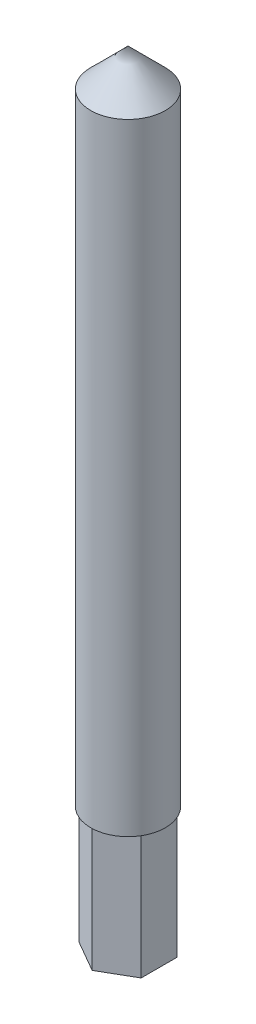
ISO-10303-21;
HEADER;
FILE_DESCRIPTION(('STEP AP214'),'2;1');
FILE_NAME('part.step','',(''),(''),'','','');
FILE_SCHEMA(('AUTOMOTIVE_DESIGN { 1 0 10303 214 1 1 1 1 }'));
ENDSEC;
DATA;
#1=APPLICATION_CONTEXT('core data for automotive mechanical design processes');
#2=APPLICATION_PROTOCOL_DEFINITION('international standard','automotive_design',2000,#1);
#3=PRODUCT_CONTEXT('',#1,'mechanical');
#4=PRODUCT('Part','Part','',(#3));
#5=PRODUCT_RELATED_PRODUCT_CATEGORY('part','',(#4));
#6=PRODUCT_DEFINITION_FORMATION('','',#4);
#7=PRODUCT_DEFINITION_CONTEXT('part definition',#1,'design');
#8=PRODUCT_DEFINITION('design','',#6,#7);
#9=PRODUCT_DEFINITION_SHAPE('','',#8);
#10=(LENGTH_UNIT() NAMED_UNIT(*) SI_UNIT(.MILLI.,.METRE.));
#11=(NAMED_UNIT(*) PLANE_ANGLE_UNIT() SI_UNIT($,.RADIAN.));
#12=(NAMED_UNIT(*) SI_UNIT($,.STERADIAN.) SOLID_ANGLE_UNIT());
#13=UNCERTAINTY_MEASURE_WITH_UNIT(LENGTH_MEASURE(1.E-05),#10,'distance_accuracy_value','');
#14=(GEOMETRIC_REPRESENTATION_CONTEXT(3) GLOBAL_UNCERTAINTY_ASSIGNED_CONTEXT((#13)) GLOBAL_UNIT_ASSIGNED_CONTEXT((#10,
#11,#12)) REPRESENTATION_CONTEXT('',''));
#15=CARTESIAN_POINT('',(0.,0.,0.));
#16=DIRECTION('',(0.,0.,1.));
#17=DIRECTION('',(1.,0.,0.));
#18=AXIS2_PLACEMENT_3D('',#15,#16,#17);
#19=CARTESIAN_POINT('',(0.,120.,0.));
#20=DIRECTION('',(0.,-1.,0.));
#21=DIRECTION('',(0.,0.,-1.));
#22=AXIS2_PLACEMENT_3D('',#19,#20,#21);
#23=CYLINDRICAL_SURFACE('',#22,6.);
#24=CARTESIAN_POINT('',(0.,120.,0.));
#25=DIRECTION('',(0.,1.,0.));
#26=DIRECTION('',(0.,0.,1.));
#27=AXIS2_PLACEMENT_3D('',#24,#25,#26);
#28=CIRCLE('',#27,6.);
#29=CARTESIAN_POINT('',(0.,120.,6.));
#30=VERTEX_POINT('',#29);
#31=EDGE_CURVE('E11',#30,#30,#28,.T.);
#32=ORIENTED_EDGE('',*,*,#31,.F.);
#33=EDGE_LOOP('',(#32));
#34=FACE_BOUND('',#33,.T.);
#35=CARTESIAN_POINT('',(0.,20.,0.));
#36=DIRECTION('',(0.,-1.,0.));
#37=DIRECTION('',(0.,0.,-1.));
#38=AXIS2_PLACEMENT_3D('',#35,#36,#37);
#39=CIRCLE('',#38,6.);
#40=CARTESIAN_POINT('',(0.,20.,-6.));
#41=VERTEX_POINT('',#40);
#42=EDGE_CURVE('E45',#41,#41,#39,.T.);
#43=ORIENTED_EDGE('',*,*,#42,.F.);
#44=EDGE_LOOP('',(#43));
#45=FACE_BOUND('',#44,.T.);
#46=ADVANCED_FACE('F38',(#34,#45),#23,.T.);
#47=CARTESIAN_POINT('',(0.,20.,0.));
#48=DIRECTION('',(0.,-1.,0.));
#49=DIRECTION('',(0.,0.,-1.));
#50=AXIS2_PLACEMENT_3D('',#47,#48,#49);
#51=PLANE('',#50);
#52=DIRECTION('',(-0.866025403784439,0.,-0.5));
#53=VECTOR('',#52,1.);
#54=CARTESIAN_POINT('',(-5.,20.,2.88675134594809));
#55=LINE('',#54,#53);
#56=CARTESIAN_POINT('',(0.,20.,5.77350269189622));
#57=VERTEX_POINT('',#56);
#58=CARTESIAN_POINT('',(-5.,20.,2.88675134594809));
#59=VERTEX_POINT('',#58);
#60=EDGE_CURVE('E113',#57,#59,#55,.T.);
#61=ORIENTED_EDGE('',*,*,#60,.F.);
#62=DIRECTION('',(-0.866025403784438,0.,0.5));
#63=VECTOR('',#62,1.);
#64=CARTESIAN_POINT('',(0.,20.,5.77350269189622));
#65=LINE('',#64,#63);
#66=CARTESIAN_POINT('',(5.00000000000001,20.,2.88675134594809));
#67=VERTEX_POINT('',#66);
#68=EDGE_CURVE('E122',#67,#57,#65,.T.);
#69=ORIENTED_EDGE('',*,*,#68,.F.);
#70=DIRECTION('',(0.,0.,1.));
#71=VECTOR('',#70,1.);
#72=CARTESIAN_POINT('',(5.00000000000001,20.,2.88675134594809));
#73=LINE('',#72,#71);
#74=CARTESIAN_POINT('',(5.00000000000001,20.,-2.88675134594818));
#75=VERTEX_POINT('',#74);
#76=EDGE_CURVE('E125',#75,#67,#73,.T.);
#77=ORIENTED_EDGE('',*,*,#76,.F.);
#78=DIRECTION('',(0.866025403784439,0.,0.5));
#79=VECTOR('',#78,1.);
#80=CARTESIAN_POINT('',(5.00000000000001,20.,-2.88675134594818));
#81=LINE('',#80,#79);
#82=CARTESIAN_POINT('',(0.,20.,-5.77350269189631));
#83=VERTEX_POINT('',#82);
#84=EDGE_CURVE('E60',#83,#75,#81,.T.);
#85=ORIENTED_EDGE('',*,*,#84,.F.);
#86=DIRECTION('',(0.866025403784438,0.,-0.500000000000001));
#87=VECTOR('',#86,1.);
#88=CARTESIAN_POINT('',(0.,20.,-5.77350269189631));
#89=LINE('',#88,#87);
#90=CARTESIAN_POINT('',(-5.00000000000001,20.,-2.88675134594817));
#91=VERTEX_POINT('',#90);
#92=EDGE_CURVE('E129',#91,#83,#89,.T.);
#93=ORIENTED_EDGE('',*,*,#92,.F.);
#94=DIRECTION('',(0.,0.,-1.));
#95=VECTOR('',#94,1.);
#96=CARTESIAN_POINT('',(-5.00000000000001,20.,-2.88675134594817));
#97=LINE('',#96,#95);
#98=EDGE_CURVE('E132',#59,#91,#97,.T.);
#99=ORIENTED_EDGE('',*,*,#98,.F.);
#100=EDGE_LOOP('',(#61,#69,#77,#85,#93,#99));
#101=FACE_BOUND('',#100,.T.);
#102=ORIENTED_EDGE('',*,*,#42,.T.);
#103=EDGE_LOOP('',(#102));
#104=FACE_BOUND('',#103,.T.);
#105=ADVANCED_FACE('F102',(#101,#104),#51,.T.);
#106=CARTESIAN_POINT('',(-5.00000000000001,20.,-2.88675134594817));
#107=DIRECTION('',(-1.,0.,0.));
#108=DIRECTION('',(0.,0.,1.));
#109=AXIS2_PLACEMENT_3D('',#106,#107,#108);
#110=PLANE('',#109);
#111=DIRECTION('',(0.,0.,-1.));
#112=VECTOR('',#111,1.);
#113=CARTESIAN_POINT('',(-5.00000000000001,0.,-2.88675134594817));
#114=LINE('',#113,#112);
#115=CARTESIAN_POINT('',(-5.,0.,2.88675134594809));
#116=VERTEX_POINT('',#115);
#117=CARTESIAN_POINT('',(-5.00000000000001,0.,-2.88675134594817));
#118=VERTEX_POINT('',#117);
#119=EDGE_CURVE('E148',#116,#118,#114,.T.);
#120=ORIENTED_EDGE('',*,*,#119,.F.);
#121=DIRECTION('',(0.,-1.,0.));
#122=VECTOR('',#121,1.);
#123=CARTESIAN_POINT('',(-5.,20.,2.88675134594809));
#124=LINE('',#123,#122);
#125=EDGE_CURVE('E106',#59,#116,#124,.T.);
#126=ORIENTED_EDGE('',*,*,#125,.F.);
#127=ORIENTED_EDGE('',*,*,#98,.T.);
#128=DIRECTION('',(0.,-1.,0.));
#129=VECTOR('',#128,1.);
#130=CARTESIAN_POINT('',(-5.00000000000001,20.,-2.88675134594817));
#131=LINE('',#130,#129);
#132=EDGE_CURVE('E110',#91,#118,#131,.T.);
#133=ORIENTED_EDGE('',*,*,#132,.T.);
#134=EDGE_LOOP('',(#120,#126,#127,#133));
#135=FACE_BOUND('',#134,.T.);
#136=ADVANCED_FACE('F155',(#135),#110,.T.);
#137=CARTESIAN_POINT('',(-5.,20.,2.88675134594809));
#138=DIRECTION('',(-0.5,0.,0.866025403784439));
#139=DIRECTION('',(0.866025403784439,0.,0.5));
#140=AXIS2_PLACEMENT_3D('',#137,#138,#139);
#141=PLANE('',#140);
#142=DIRECTION('',(-0.866025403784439,0.,-0.5));
#143=VECTOR('',#142,1.);
#144=CARTESIAN_POINT('',(-5.,0.,2.88675134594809));
#145=LINE('',#144,#143);
#146=CARTESIAN_POINT('',(0.,0.,5.77350269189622));
#147=VERTEX_POINT('',#146);
#148=EDGE_CURVE('E135',#147,#116,#145,.T.);
#149=ORIENTED_EDGE('',*,*,#148,.F.);
#150=DIRECTION('',(0.,-1.,0.));
#151=VECTOR('',#150,1.);
#152=CARTESIAN_POINT('',(0.,20.,5.77350269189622));
#153=LINE('',#152,#151);
#154=EDGE_CURVE('E107',#57,#147,#153,.T.);
#155=ORIENTED_EDGE('',*,*,#154,.F.);
#156=ORIENTED_EDGE('',*,*,#60,.T.);
#157=ORIENTED_EDGE('',*,*,#125,.T.);
#158=EDGE_LOOP('',(#149,#155,#156,#157));
#159=FACE_BOUND('',#158,.T.);
#160=ADVANCED_FACE('F169',(#159),#141,.T.);
#161=CARTESIAN_POINT('',(0.,20.,5.77350269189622));
#162=DIRECTION('',(0.5,0.,0.866025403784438));
#163=DIRECTION('',(0.866025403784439,0.,-0.5));
#164=AXIS2_PLACEMENT_3D('',#161,#162,#163);
#165=PLANE('',#164);
#166=DIRECTION('',(-0.866025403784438,0.,0.5));
#167=VECTOR('',#166,1.);
#168=CARTESIAN_POINT('',(0.,0.,5.77350269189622));
#169=LINE('',#168,#167);
#170=CARTESIAN_POINT('',(5.00000000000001,0.,2.88675134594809));
#171=VERTEX_POINT('',#170);
#172=EDGE_CURVE('E138',#171,#147,#169,.T.);
#173=ORIENTED_EDGE('',*,*,#172,.F.);
#174=DIRECTION('',(0.,-1.,0.));
#175=VECTOR('',#174,1.);
#176=CARTESIAN_POINT('',(5.00000000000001,20.,2.88675134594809));
#177=LINE('',#176,#175);
#178=EDGE_CURVE('E117',#67,#171,#177,.T.);
#179=ORIENTED_EDGE('',*,*,#178,.F.);
#180=ORIENTED_EDGE('',*,*,#68,.T.);
#181=ORIENTED_EDGE('',*,*,#154,.T.);
#182=EDGE_LOOP('',(#173,#179,#180,#181));
#183=FACE_BOUND('',#182,.T.);
#184=ADVANCED_FACE('F165',(#183),#165,.T.);
#185=CARTESIAN_POINT('',(5.00000000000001,20.,2.88675134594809));
#186=DIRECTION('',(1.,0.,0.));
#187=DIRECTION('',(0.,0.,-1.));
#188=AXIS2_PLACEMENT_3D('',#185,#186,#187);
#189=PLANE('',#188);
#190=DIRECTION('',(0.,0.,1.));
#191=VECTOR('',#190,1.);
#192=CARTESIAN_POINT('',(5.00000000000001,0.,2.88675134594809));
#193=LINE('',#192,#191);
#194=CARTESIAN_POINT('',(5.00000000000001,0.,-2.88675134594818));
#195=VERTEX_POINT('',#194);
#196=EDGE_CURVE('E141',#195,#171,#193,.T.);
#197=ORIENTED_EDGE('',*,*,#196,.F.);
#198=DIRECTION('',(0.,-1.,0.));
#199=VECTOR('',#198,1.);
#200=CARTESIAN_POINT('',(5.00000000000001,20.,-2.88675134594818));
#201=LINE('',#200,#199);
#202=EDGE_CURVE('E115',#75,#195,#201,.T.);
#203=ORIENTED_EDGE('',*,*,#202,.F.);
#204=ORIENTED_EDGE('',*,*,#76,.T.);
#205=ORIENTED_EDGE('',*,*,#178,.T.);
#206=EDGE_LOOP('',(#197,#203,#204,#205));
#207=FACE_BOUND('',#206,.T.);
#208=ADVANCED_FACE('F162',(#207),#189,.T.);
#209=CARTESIAN_POINT('',(5.00000000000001,20.,-2.88675134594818));
#210=DIRECTION('',(0.5,0.,-0.866025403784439));
#211=DIRECTION('',(-0.866025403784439,0.,-0.5));
#212=AXIS2_PLACEMENT_3D('',#209,#210,#211);
#213=PLANE('',#212);
#214=DIRECTION('',(0.866025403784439,0.,0.5));
#215=VECTOR('',#214,1.);
#216=CARTESIAN_POINT('',(5.00000000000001,0.,-2.88675134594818));
#217=LINE('',#216,#215);
#218=CARTESIAN_POINT('',(0.,0.,-5.77350269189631));
#219=VERTEX_POINT('',#218);
#220=EDGE_CURVE('E52',#219,#195,#217,.T.);
#221=ORIENTED_EDGE('',*,*,#220,.F.);
#222=DIRECTION('',(0.,-1.,0.));
#223=VECTOR('',#222,1.);
#224=CARTESIAN_POINT('',(0.,20.,-5.77350269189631));
#225=LINE('',#224,#223);
#226=EDGE_CURVE('E112',#83,#219,#225,.T.);
#227=ORIENTED_EDGE('',*,*,#226,.F.);
#228=ORIENTED_EDGE('',*,*,#84,.T.);
#229=ORIENTED_EDGE('',*,*,#202,.T.);
#230=EDGE_LOOP('',(#221,#227,#228,#229));
#231=FACE_BOUND('',#230,.T.);
#232=ADVANCED_FACE('F159',(#231),#213,.T.);
#233=CARTESIAN_POINT('',(0.,20.,-5.77350269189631));
#234=DIRECTION('',(-0.500000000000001,0.,-0.866025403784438));
#235=DIRECTION('',(-0.866025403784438,0.,0.500000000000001));
#236=AXIS2_PLACEMENT_3D('',#233,#234,#235);
#237=PLANE('',#236);
#238=DIRECTION('',(0.866025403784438,0.,-0.500000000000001));
#239=VECTOR('',#238,1.);
#240=CARTESIAN_POINT('',(0.,0.,-5.77350269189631));
#241=LINE('',#240,#239);
#242=EDGE_CURVE('E145',#118,#219,#241,.T.);
#243=ORIENTED_EDGE('',*,*,#242,.F.);
#244=ORIENTED_EDGE('',*,*,#132,.F.);
#245=ORIENTED_EDGE('',*,*,#92,.T.);
#246=ORIENTED_EDGE('',*,*,#226,.T.);
#247=EDGE_LOOP('',(#243,#244,#245,#246));
#248=FACE_BOUND('',#247,.T.);
#249=ADVANCED_FACE('F158',(#248),#237,.T.);
#250=CARTESIAN_POINT('',(0.,0.,0.));
#251=DIRECTION('',(0.,1.,0.));
#252=DIRECTION('',(0.,0.,1.));
#253=AXIS2_PLACEMENT_3D('',#250,#251,#252);
#254=PLANE('',#253);
#255=ORIENTED_EDGE('',*,*,#119,.T.);
#256=ORIENTED_EDGE('',*,*,#242,.T.);
#257=ORIENTED_EDGE('',*,*,#220,.T.);
#258=ORIENTED_EDGE('',*,*,#196,.T.);
#259=ORIENTED_EDGE('',*,*,#172,.T.);
#260=ORIENTED_EDGE('',*,*,#148,.T.);
#261=EDGE_LOOP('',(#255,#256,#257,#258,#259,#260));
#262=FACE_BOUND('',#261,.T.);
#263=ADVANCED_FACE('F96',(#262),#254,.F.);
#264=CARTESIAN_POINT('',(0.,120.,0.));
#265=DIRECTION('',(0.,-1.,0.));
#266=DIRECTION('',(0.,0.,-1.));
#267=AXIS2_PLACEMENT_3D('',#264,#265,#266);
#268=CONICAL_SURFACE('',#267,6.,0.785398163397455);
#269=CARTESIAN_POINT('',(0.,126.,0.));
#270=VERTEX_POINT('',#269);
#271=VERTEX_LOOP('',#270);
#272=FACE_BOUND('',#271,.T.);
#273=ORIENTED_EDGE('',*,*,#31,.T.);
#274=EDGE_LOOP('',(#273));
#275=FACE_BOUND('',#274,.T.);
#276=ADVANCED_FACE('F93',(#272,#275),#268,.T.);
#277=CLOSED_SHELL('',(#46,#105,#136,#160,#184,#208,#232,#249,#263,#276));
#278=MANIFOLD_SOLID_BREP('B2',#277);
#279=ADVANCED_BREP_SHAPE_REPRESENTATION('',(#18,#278),#14);
#280=SHAPE_DEFINITION_REPRESENTATION(#9,#279);
ENDSEC;
END-ISO-10303-21;
